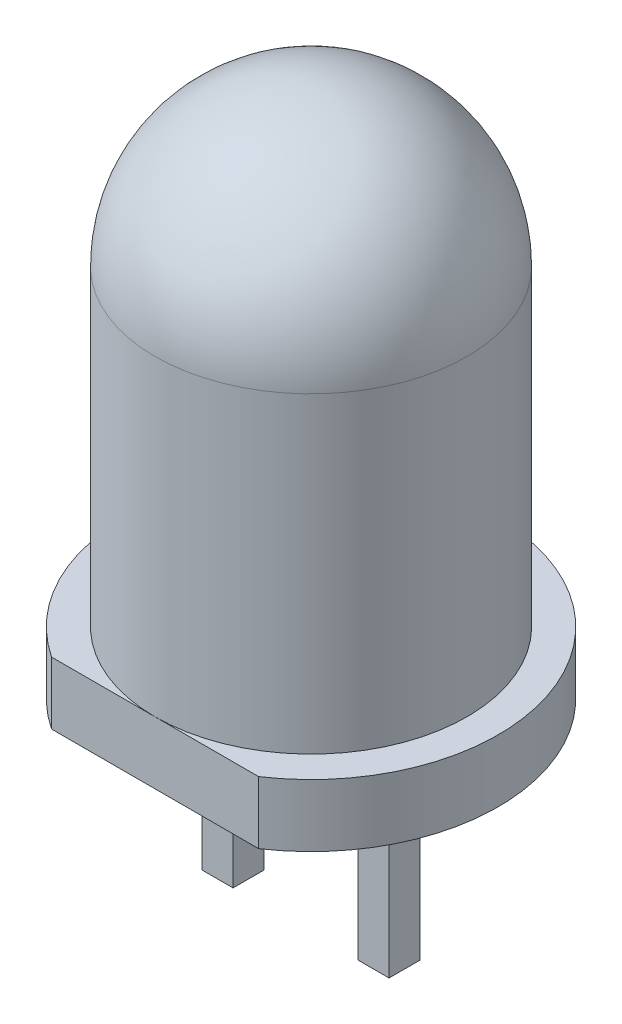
ISO-10303-21;
HEADER;
FILE_DESCRIPTION(('STEP AP214'),'2;1');
FILE_NAME('part.step','',(''),(''),'','','');
FILE_SCHEMA(('AUTOMOTIVE_DESIGN { 1 0 10303 214 1 1 1 1 }'));
ENDSEC;
DATA;
#1=APPLICATION_CONTEXT('core data for automotive mechanical design processes');
#2=APPLICATION_PROTOCOL_DEFINITION('international standard','automotive_design',2000,#1);
#3=PRODUCT_CONTEXT('',#1,'mechanical');
#4=PRODUCT('Part','Part','',(#3));
#5=PRODUCT_RELATED_PRODUCT_CATEGORY('part','',(#4));
#6=PRODUCT_DEFINITION_FORMATION('','',#4);
#7=PRODUCT_DEFINITION_CONTEXT('part definition',#1,'design');
#8=PRODUCT_DEFINITION('design','',#6,#7);
#9=PRODUCT_DEFINITION_SHAPE('','',#8);
#10=(LENGTH_UNIT() NAMED_UNIT(*) SI_UNIT(.MILLI.,.METRE.));
#11=(NAMED_UNIT(*) PLANE_ANGLE_UNIT() SI_UNIT($,.RADIAN.));
#12=(NAMED_UNIT(*) SI_UNIT($,.STERADIAN.) SOLID_ANGLE_UNIT());
#13=UNCERTAINTY_MEASURE_WITH_UNIT(LENGTH_MEASURE(1.E-05),#10,'distance_accuracy_value','');
#14=(GEOMETRIC_REPRESENTATION_CONTEXT(3) GLOBAL_UNCERTAINTY_ASSIGNED_CONTEXT((#13)) GLOBAL_UNIT_ASSIGNED_CONTEXT((#10,
#11,#12)) REPRESENTATION_CONTEXT('',''));
#15=CARTESIAN_POINT('',(0.,0.,0.));
#16=DIRECTION('',(0.,0.,1.));
#17=DIRECTION('',(1.,0.,0.));
#18=AXIS2_PLACEMENT_3D('',#15,#16,#17);
#19=CARTESIAN_POINT('',(0.,0.,0.));
#20=DIRECTION('',(0.,1.,0.));
#21=DIRECTION('',(0.,0.,1.));
#22=AXIS2_PLACEMENT_3D('',#19,#20,#21);
#23=PLANE('',#22);
#24=DIRECTION('',(0.,0.,-1.));
#25=VECTOR('',#24,1.);
#26=CARTESIAN_POINT('',(1.,0.,-0.25));
#27=LINE('',#26,#25);
#28=CARTESIAN_POINT('',(1.,0.,0.25));
#29=VERTEX_POINT('',#28);
#30=CARTESIAN_POINT('',(1.,0.,-0.25));
#31=VERTEX_POINT('',#30);
#32=EDGE_CURVE('E134',#29,#31,#27,.T.);
#33=ORIENTED_EDGE('',*,*,#32,.F.);
#34=DIRECTION('',(-1.,0.,0.));
#35=VECTOR('',#34,1.);
#36=CARTESIAN_POINT('',(1.,0.,0.25));
#37=LINE('',#36,#35);
#38=CARTESIAN_POINT('',(1.5,0.,0.25));
#39=VERTEX_POINT('',#38);
#40=EDGE_CURVE('E147',#39,#29,#37,.T.);
#41=ORIENTED_EDGE('',*,*,#40,.F.);
#42=DIRECTION('',(0.,0.,1.));
#43=VECTOR('',#42,1.);
#44=CARTESIAN_POINT('',(1.5,0.,-0.25));
#45=LINE('',#44,#43);
#46=CARTESIAN_POINT('',(1.5,0.,-0.25));
#47=VERTEX_POINT('',#46);
#48=EDGE_CURVE('E156',#47,#39,#45,.T.);
#49=ORIENTED_EDGE('',*,*,#48,.F.);
#50=DIRECTION('',(1.,0.,0.));
#51=VECTOR('',#50,1.);
#52=CARTESIAN_POINT('',(1.,0.,-0.25));
#53=LINE('',#52,#51);
#54=EDGE_CURVE('E137',#31,#47,#53,.T.);
#55=ORIENTED_EDGE('',*,*,#54,.F.);
#56=EDGE_LOOP('',(#33,#41,#49,#55));
#57=FACE_BOUND('',#56,.T.);
#58=CARTESIAN_POINT('',(0.,0.,0.));
#59=DIRECTION('',(0.,1.,0.));
#60=DIRECTION('',(0.,0.,1.));
#61=AXIS2_PLACEMENT_3D('',#58,#59,#60);
#62=CIRCLE('',#61,3.);
#63=CARTESIAN_POINT('',(1.6583123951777,0.,2.5));
#64=VERTEX_POINT('',#63);
#65=CARTESIAN_POINT('',(-1.6583123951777,0.,2.5));
#66=VERTEX_POINT('',#65);
#67=EDGE_CURVE('E182',#64,#66,#62,.T.);
#68=ORIENTED_EDGE('',*,*,#67,.F.);
#69=DIRECTION('',(1.,0.,0.));
#70=VECTOR('',#69,1.);
#71=CARTESIAN_POINT('',(-1.6583123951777,0.,2.5));
#72=LINE('',#71,#70);
#73=EDGE_CURVE('E179',#66,#64,#72,.T.);
#74=ORIENTED_EDGE('',*,*,#73,.F.);
#75=EDGE_LOOP('',(#68,#74));
#76=FACE_BOUND('',#75,.T.);
#77=DIRECTION('',(1.,0.,0.));
#78=VECTOR('',#77,1.);
#79=CARTESIAN_POINT('',(-1.,0.,-0.25));
#80=LINE('',#79,#78);
#81=CARTESIAN_POINT('',(-1.5,0.,-0.25));
#82=VERTEX_POINT('',#81);
#83=CARTESIAN_POINT('',(-1.,0.,-0.25));
#84=VERTEX_POINT('',#83);
#85=EDGE_CURVE('E133',#82,#84,#80,.T.);
#86=ORIENTED_EDGE('',*,*,#85,.F.);
#87=DIRECTION('',(0.,0.,-1.));
#88=VECTOR('',#87,1.);
#89=CARTESIAN_POINT('',(-1.5,0.,-0.25));
#90=LINE('',#89,#88);
#91=CARTESIAN_POINT('',(-1.5,0.,0.25));
#92=VERTEX_POINT('',#91);
#93=EDGE_CURVE('E130',#92,#82,#90,.T.);
#94=ORIENTED_EDGE('',*,*,#93,.F.);
#95=DIRECTION('',(-1.,0.,0.));
#96=VECTOR('',#95,1.);
#97=CARTESIAN_POINT('',(-1.,0.,0.25));
#98=LINE('',#97,#96);
#99=CARTESIAN_POINT('',(-1.,0.,0.25));
#100=VERTEX_POINT('',#99);
#101=EDGE_CURVE('E53',#100,#92,#98,.T.);
#102=ORIENTED_EDGE('',*,*,#101,.F.);
#103=DIRECTION('',(0.,0.,1.));
#104=VECTOR('',#103,1.);
#105=CARTESIAN_POINT('',(-1.,0.,-0.25));
#106=LINE('',#105,#104);
#107=EDGE_CURVE('E48',#84,#100,#106,.T.);
#108=ORIENTED_EDGE('',*,*,#107,.F.);
#109=EDGE_LOOP('',(#86,#94,#102,#108));
#110=FACE_BOUND('',#109,.T.);
#111=ADVANCED_FACE('F32',(#57,#76,#110),#23,.F.);
#112=CARTESIAN_POINT('',(0.,1.,0.));
#113=DIRECTION('',(0.,-1.,0.));
#114=DIRECTION('',(0.,0.,-1.));
#115=AXIS2_PLACEMENT_3D('',#112,#113,#114);
#116=CYLINDRICAL_SURFACE('',#115,3.);
#117=ORIENTED_EDGE('',*,*,#67,.T.);
#118=DIRECTION('',(0.,-1.,0.));
#119=VECTOR('',#118,1.);
#120=CARTESIAN_POINT('',(-1.6583123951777,1.,2.5));
#121=LINE('',#120,#119);
#122=CARTESIAN_POINT('',(-1.6583123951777,1.,2.5));
#123=VERTEX_POINT('',#122);
#124=EDGE_CURVE('E11',#123,#66,#121,.T.);
#125=ORIENTED_EDGE('',*,*,#124,.F.);
#126=CARTESIAN_POINT('',(0.,1.,0.));
#127=DIRECTION('',(0.,1.,0.));
#128=DIRECTION('',(0.,0.,1.));
#129=AXIS2_PLACEMENT_3D('',#126,#127,#128);
#130=CIRCLE('',#129,3.);
#131=CARTESIAN_POINT('',(1.6583123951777,1.,2.5));
#132=VERTEX_POINT('',#131);
#133=EDGE_CURVE('E175',#132,#123,#130,.T.);
#134=ORIENTED_EDGE('',*,*,#133,.F.);
#135=DIRECTION('',(0.,-1.,0.));
#136=VECTOR('',#135,1.);
#137=CARTESIAN_POINT('',(1.6583123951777,1.,2.5));
#138=LINE('',#137,#136);
#139=EDGE_CURVE('E41',#132,#64,#138,.T.);
#140=ORIENTED_EDGE('',*,*,#139,.T.);
#141=EDGE_LOOP('',(#117,#125,#134,#140));
#142=FACE_BOUND('',#141,.T.);
#143=ADVANCED_FACE('F191',(#142),#116,.T.);
#144=CARTESIAN_POINT('',(-1.6583123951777,1.,2.5));
#145=DIRECTION('',(0.,0.,-1.));
#146=DIRECTION('',(-1.,0.,0.));
#147=AXIS2_PLACEMENT_3D('',#144,#145,#146);
#148=PLANE('',#147);
#149=ORIENTED_EDGE('',*,*,#73,.T.);
#150=ORIENTED_EDGE('',*,*,#139,.F.);
#151=DIRECTION('',(1.,0.,0.));
#152=VECTOR('',#151,1.);
#153=CARTESIAN_POINT('',(-1.6583123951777,1.,2.5));
#154=LINE('',#153,#152);
#155=CARTESIAN_POINT('',(0.,1.,2.5));
#156=VERTEX_POINT('',#155);
#157=EDGE_CURVE('E178',#156,#132,#154,.T.);
#158=ORIENTED_EDGE('',*,*,#157,.F.);
#159=EDGE_CURVE('E180',#123,#156,#154,.T.);
#160=ORIENTED_EDGE('',*,*,#159,.F.);
#161=ORIENTED_EDGE('',*,*,#124,.T.);
#162=EDGE_LOOP('',(#149,#150,#158,#160,#161));
#163=FACE_BOUND('',#162,.T.);
#164=ADVANCED_FACE('F196',(#163),#148,.F.);
#165=CARTESIAN_POINT('',(0.,1.,0.));
#166=DIRECTION('',(0.,1.,0.));
#167=DIRECTION('',(0.,0.,1.));
#168=AXIS2_PLACEMENT_3D('',#165,#166,#167);
#169=PLANE('',#168);
#170=ORIENTED_EDGE('',*,*,#159,.T.);
#171=CARTESIAN_POINT('',(0.,1.,0.));
#172=DIRECTION('',(0.,1.,0.));
#173=DIRECTION('',(0.,0.,1.));
#174=AXIS2_PLACEMENT_3D('',#171,#172,#173);
#175=CIRCLE('',#174,2.5);
#176=EDGE_CURVE('E172',#156,#156,#175,.T.);
#177=ORIENTED_EDGE('',*,*,#176,.F.);
#178=ORIENTED_EDGE('',*,*,#157,.T.);
#179=ORIENTED_EDGE('',*,*,#133,.T.);
#180=EDGE_LOOP('',(#170,#177,#178,#179));
#181=FACE_BOUND('',#180,.T.);
#182=ADVANCED_FACE('F199',(#181),#169,.T.);
#183=CARTESIAN_POINT('',(0.,6.,0.));
#184=DIRECTION('',(0.,-1.,0.));
#185=DIRECTION('',(0.,0.,-1.));
#186=AXIS2_PLACEMENT_3D('',#183,#184,#185);
#187=CYLINDRICAL_SURFACE('',#186,2.5);
#188=CARTESIAN_POINT('',(0.,6.,0.));
#189=DIRECTION('',(0.,1.,0.));
#190=DIRECTION('',(0.,0.,1.));
#191=AXIS2_PLACEMENT_3D('',#188,#189,#190);
#192=CIRCLE('',#191,2.5);
#193=CARTESIAN_POINT('',(0.,6.,2.5));
#194=VERTEX_POINT('',#193);
#195=EDGE_CURVE('E36',#194,#194,#192,.T.);
#196=ORIENTED_EDGE('',*,*,#195,.F.);
#197=EDGE_LOOP('',(#196));
#198=FACE_BOUND('',#197,.T.);
#199=ORIENTED_EDGE('',*,*,#176,.T.);
#200=EDGE_LOOP('',(#199));
#201=FACE_BOUND('',#200,.T.);
#202=ADVANCED_FACE('F201',(#198,#201),#187,.T.);
#203=CARTESIAN_POINT('',(0.,6.,0.));
#204=DIRECTION('',(0.,0.,1.));
#205=DIRECTION('',(1.,0.,0.));
#206=AXIS2_PLACEMENT_3D('',#203,#204,#205);
#207=SPHERICAL_SURFACE('',#206,2.5);
#208=CARTESIAN_POINT('',(0.,6.,0.));
#209=DIRECTION('',(0.,1.,0.));
#210=DIRECTION('',(0.,0.,1.));
#211=AXIS2_PLACEMENT_3D('',#208,#209,#210);
#212=SPHERICAL_SURFACE('',#211,2.5);
#213=ORIENTED_EDGE('',*,*,#195,.T.);
#214=EDGE_LOOP('',(#213));
#215=FACE_BOUND('',#214,.T.);
#216=ADVANCED_FACE('F34',(#215),#212,.T.);
#217=CARTESIAN_POINT('',(1.,-3.,-0.25));
#218=DIRECTION('',(1.,0.,0.));
#219=DIRECTION('',(0.,0.,-1.));
#220=AXIS2_PLACEMENT_3D('',#217,#218,#219);
#221=PLANE('',#220);
#222=ORIENTED_EDGE('',*,*,#32,.T.);
#223=DIRECTION('',(0.,1.,0.));
#224=VECTOR('',#223,1.);
#225=CARTESIAN_POINT('',(1.,-3.,-0.25));
#226=LINE('',#225,#224);
#227=CARTESIAN_POINT('',(1.,-3.,-0.25));
#228=VERTEX_POINT('',#227);
#229=EDGE_CURVE('E169',#228,#31,#226,.T.);
#230=ORIENTED_EDGE('',*,*,#229,.F.);
#231=DIRECTION('',(0.,0.,-1.));
#232=VECTOR('',#231,1.);
#233=CARTESIAN_POINT('',(1.,-3.,-0.25));
#234=LINE('',#233,#232);
#235=CARTESIAN_POINT('',(1.,-3.,0.25));
#236=VERTEX_POINT('',#235);
#237=EDGE_CURVE('E143',#236,#228,#234,.T.);
#238=ORIENTED_EDGE('',*,*,#237,.F.);
#239=DIRECTION('',(0.,1.,0.));
#240=VECTOR('',#239,1.);
#241=CARTESIAN_POINT('',(1.,-3.,0.25));
#242=LINE('',#241,#240);
#243=EDGE_CURVE('E152',#236,#29,#242,.T.);
#244=ORIENTED_EDGE('',*,*,#243,.T.);
#245=EDGE_LOOP('',(#222,#230,#238,#244));
#246=FACE_BOUND('',#245,.T.);
#247=ADVANCED_FACE('F209',(#246),#221,.F.);
#248=CARTESIAN_POINT('',(1.,-3.,-0.25));
#249=DIRECTION('',(0.,0.,1.));
#250=DIRECTION('',(1.,0.,0.));
#251=AXIS2_PLACEMENT_3D('',#248,#249,#250);
#252=PLANE('',#251);
#253=ORIENTED_EDGE('',*,*,#54,.T.);
#254=DIRECTION('',(0.,1.,0.));
#255=VECTOR('',#254,1.);
#256=CARTESIAN_POINT('',(1.5,-3.,-0.25));
#257=LINE('',#256,#255);
#258=CARTESIAN_POINT('',(1.5,-3.,-0.25));
#259=VERTEX_POINT('',#258);
#260=EDGE_CURVE('E166',#259,#47,#257,.T.);
#261=ORIENTED_EDGE('',*,*,#260,.F.);
#262=DIRECTION('',(1.,0.,0.));
#263=VECTOR('',#262,1.);
#264=CARTESIAN_POINT('',(1.,-3.,-0.25));
#265=LINE('',#264,#263);
#266=EDGE_CURVE('E146',#228,#259,#265,.T.);
#267=ORIENTED_EDGE('',*,*,#266,.F.);
#268=ORIENTED_EDGE('',*,*,#229,.T.);
#269=EDGE_LOOP('',(#253,#261,#267,#268));
#270=FACE_BOUND('',#269,.T.);
#271=ADVANCED_FACE('F253',(#270),#252,.F.);
#272=CARTESIAN_POINT('',(1.5,-3.,-0.25));
#273=DIRECTION('',(-1.,0.,0.));
#274=DIRECTION('',(0.,0.,1.));
#275=AXIS2_PLACEMENT_3D('',#272,#273,#274);
#276=PLANE('',#275);
#277=ORIENTED_EDGE('',*,*,#48,.T.);
#278=DIRECTION('',(0.,1.,0.));
#279=VECTOR('',#278,1.);
#280=CARTESIAN_POINT('',(1.5,-3.,0.25));
#281=LINE('',#280,#279);
#282=CARTESIAN_POINT('',(1.5,-3.,0.25));
#283=VERTEX_POINT('',#282);
#284=EDGE_CURVE('E163',#283,#39,#281,.T.);
#285=ORIENTED_EDGE('',*,*,#284,.F.);
#286=DIRECTION('',(0.,0.,1.));
#287=VECTOR('',#286,1.);
#288=CARTESIAN_POINT('',(1.5,-3.,-0.25));
#289=LINE('',#288,#287);
#290=EDGE_CURVE('E149',#259,#283,#289,.T.);
#291=ORIENTED_EDGE('',*,*,#290,.F.);
#292=ORIENTED_EDGE('',*,*,#260,.T.);
#293=EDGE_LOOP('',(#277,#285,#291,#292));
#294=FACE_BOUND('',#293,.T.);
#295=ADVANCED_FACE('F262',(#294),#276,.F.);
#296=CARTESIAN_POINT('',(1.,-3.,0.25));
#297=DIRECTION('',(0.,0.,-1.));
#298=DIRECTION('',(-1.,0.,0.));
#299=AXIS2_PLACEMENT_3D('',#296,#297,#298);
#300=PLANE('',#299);
#301=ORIENTED_EDGE('',*,*,#40,.T.);
#302=ORIENTED_EDGE('',*,*,#243,.F.);
#303=DIRECTION('',(-1.,0.,0.));
#304=VECTOR('',#303,1.);
#305=CARTESIAN_POINT('',(1.,-3.,0.25));
#306=LINE('',#305,#304);
#307=EDGE_CURVE('E151',#283,#236,#306,.T.);
#308=ORIENTED_EDGE('',*,*,#307,.F.);
#309=ORIENTED_EDGE('',*,*,#284,.T.);
#310=EDGE_LOOP('',(#301,#302,#308,#309));
#311=FACE_BOUND('',#310,.T.);
#312=ADVANCED_FACE('F272',(#311),#300,.F.);
#313=CARTESIAN_POINT('',(1.,-3.,0.25));
#314=DIRECTION('',(0.,1.,0.));
#315=DIRECTION('',(0.,0.,1.));
#316=AXIS2_PLACEMENT_3D('',#313,#314,#315);
#317=PLANE('',#316);
#318=ORIENTED_EDGE('',*,*,#237,.T.);
#319=ORIENTED_EDGE('',*,*,#266,.T.);
#320=ORIENTED_EDGE('',*,*,#290,.T.);
#321=ORIENTED_EDGE('',*,*,#307,.T.);
#322=EDGE_LOOP('',(#318,#319,#320,#321));
#323=FACE_BOUND('',#322,.T.);
#324=ADVANCED_FACE('F282',(#323),#317,.F.);
#325=CARTESIAN_POINT('',(-1.,-3.,-0.25));
#326=DIRECTION('',(0.,0.,1.));
#327=DIRECTION('',(1.,0.,0.));
#328=AXIS2_PLACEMENT_3D('',#325,#326,#327);
#329=PLANE('',#328);
#330=ORIENTED_EDGE('',*,*,#85,.T.);
#331=DIRECTION('',(0.,1.,0.));
#332=VECTOR('',#331,1.);
#333=CARTESIAN_POINT('',(-1.,-3.,-0.25));
#334=LINE('',#333,#332);
#335=CARTESIAN_POINT('',(-1.,-3.,-0.25));
#336=VERTEX_POINT('',#335);
#337=EDGE_CURVE('E114',#336,#84,#334,.T.);
#338=ORIENTED_EDGE('',*,*,#337,.F.);
#339=DIRECTION('',(1.,0.,0.));
#340=VECTOR('',#339,1.);
#341=CARTESIAN_POINT('',(-1.,-3.,-0.25));
#342=LINE('',#341,#340);
#343=CARTESIAN_POINT('',(-1.5,-3.,-0.25));
#344=VERTEX_POINT('',#343);
#345=EDGE_CURVE('E121',#344,#336,#342,.T.);
#346=ORIENTED_EDGE('',*,*,#345,.F.);
#347=DIRECTION('',(0.,1.,0.));
#348=VECTOR('',#347,1.);
#349=CARTESIAN_POINT('',(-1.5,-3.,-0.25));
#350=LINE('',#349,#348);
#351=EDGE_CURVE('E342',#344,#82,#350,.T.);
#352=ORIENTED_EDGE('',*,*,#351,.T.);
#353=EDGE_LOOP('',(#330,#338,#346,#352));
#354=FACE_BOUND('',#353,.T.);
#355=ADVANCED_FACE('F132',(#354),#329,.F.);
#356=CARTESIAN_POINT('',(-1.,-3.,-0.25));
#357=DIRECTION('',(-1.,0.,0.));
#358=DIRECTION('',(0.,0.,1.));
#359=AXIS2_PLACEMENT_3D('',#356,#357,#358);
#360=PLANE('',#359);
#361=ORIENTED_EDGE('',*,*,#107,.T.);
#362=DIRECTION('',(0.,1.,0.));
#363=VECTOR('',#362,1.);
#364=CARTESIAN_POINT('',(-1.,-3.,0.25));
#365=LINE('',#364,#363);
#366=CARTESIAN_POINT('',(-1.,-3.,0.25));
#367=VERTEX_POINT('',#366);
#368=EDGE_CURVE('E117',#367,#100,#365,.T.);
#369=ORIENTED_EDGE('',*,*,#368,.F.);
#370=DIRECTION('',(0.,0.,1.));
#371=VECTOR('',#370,1.);
#372=CARTESIAN_POINT('',(-1.,-3.,-0.25));
#373=LINE('',#372,#371);
#374=EDGE_CURVE('E110',#336,#367,#373,.T.);
#375=ORIENTED_EDGE('',*,*,#374,.F.);
#376=ORIENTED_EDGE('',*,*,#337,.T.);
#377=EDGE_LOOP('',(#361,#369,#375,#376));
#378=FACE_BOUND('',#377,.T.);
#379=ADVANCED_FACE('F112',(#378),#360,.F.);
#380=CARTESIAN_POINT('',(-1.,-3.,0.25));
#381=DIRECTION('',(0.,0.,-1.));
#382=DIRECTION('',(-1.,0.,0.));
#383=AXIS2_PLACEMENT_3D('',#380,#381,#382);
#384=PLANE('',#383);
#385=ORIENTED_EDGE('',*,*,#101,.T.);
#386=DIRECTION('',(0.,1.,0.));
#387=VECTOR('',#386,1.);
#388=CARTESIAN_POINT('',(-1.5,-3.,0.25));
#389=LINE('',#388,#387);
#390=CARTESIAN_POINT('',(-1.5,-3.,0.25));
#391=VERTEX_POINT('',#390);
#392=EDGE_CURVE('E139',#391,#92,#389,.T.);
#393=ORIENTED_EDGE('',*,*,#392,.F.);
#394=DIRECTION('',(-1.,0.,0.));
#395=VECTOR('',#394,1.);
#396=CARTESIAN_POINT('',(-1.,-3.,0.25));
#397=LINE('',#396,#395);
#398=EDGE_CURVE('E120',#367,#391,#397,.T.);
#399=ORIENTED_EDGE('',*,*,#398,.F.);
#400=ORIENTED_EDGE('',*,*,#368,.T.);
#401=EDGE_LOOP('',(#385,#393,#399,#400));
#402=FACE_BOUND('',#401,.T.);
#403=ADVANCED_FACE('F309',(#402),#384,.F.);
#404=CARTESIAN_POINT('',(-1.5,-3.,-0.25));
#405=DIRECTION('',(1.,0.,0.));
#406=DIRECTION('',(0.,0.,-1.));
#407=AXIS2_PLACEMENT_3D('',#404,#405,#406);
#408=PLANE('',#407);
#409=ORIENTED_EDGE('',*,*,#93,.T.);
#410=ORIENTED_EDGE('',*,*,#351,.F.);
#411=DIRECTION('',(0.,0.,-1.));
#412=VECTOR('',#411,1.);
#413=CARTESIAN_POINT('',(-1.5,-3.,-0.25));
#414=LINE('',#413,#412);
#415=EDGE_CURVE('E126',#391,#344,#414,.T.);
#416=ORIENTED_EDGE('',*,*,#415,.F.);
#417=ORIENTED_EDGE('',*,*,#392,.T.);
#418=EDGE_LOOP('',(#409,#410,#416,#417));
#419=FACE_BOUND('',#418,.T.);
#420=ADVANCED_FACE('F318',(#419),#408,.F.);
#421=CARTESIAN_POINT('',(-1.5,-3.,-0.25));
#422=DIRECTION('',(0.,1.,0.));
#423=DIRECTION('',(0.,0.,1.));
#424=AXIS2_PLACEMENT_3D('',#421,#422,#423);
#425=PLANE('',#424);
#426=ORIENTED_EDGE('',*,*,#345,.T.);
#427=ORIENTED_EDGE('',*,*,#374,.T.);
#428=ORIENTED_EDGE('',*,*,#398,.T.);
#429=ORIENTED_EDGE('',*,*,#415,.T.);
#430=EDGE_LOOP('',(#426,#427,#428,#429));
#431=FACE_BOUND('',#430,.T.);
#432=ADVANCED_FACE('F124',(#431),#425,.F.);
#433=CLOSED_SHELL('',(#111,#143,#164,#182,#202,#216,#247,#271,#295,#312,#324,#355,#379,#403,
#420,#432));
#434=MANIFOLD_SOLID_BREP('B2',#433);
#435=ADVANCED_BREP_SHAPE_REPRESENTATION('',(#18,#434),#14);
#436=SHAPE_DEFINITION_REPRESENTATION(#9,#435);
ENDSEC;
END-ISO-10303-21;
